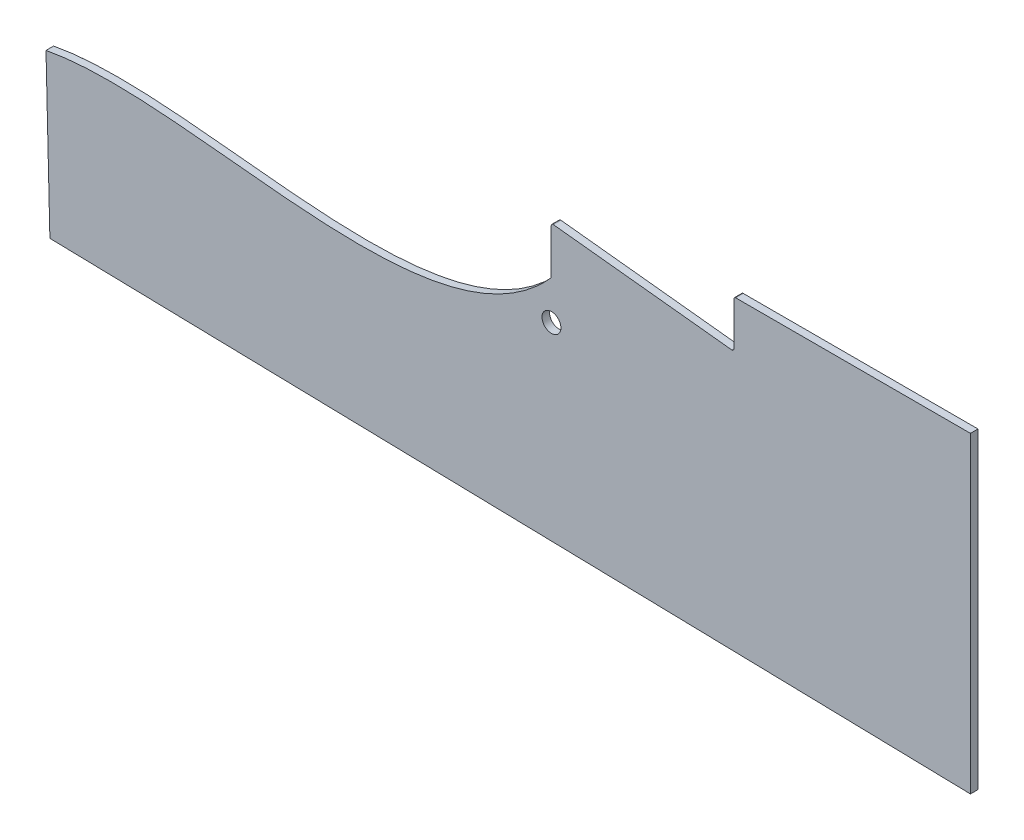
from build123d import *

# Parameters (mm, degrees)
DODANIE_WYCI_GNI_CIE1_DEPTH = 4
SZKIC2_R                    = 5
WYTNIJ_WYCI_GNI_CIE4_DEPTH  = 10
ZAOKR_GLENIE1_R             = 1


with BuildPart() as part:
    # Szkic1 → Dodanie-wyci_gni_cie1 (new body)
    with BuildSketch(Plane.XY):
        with BuildLine():
            Line((0, 170.274469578), (0, 145.274469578))
            add(Edge.make_bspline(
                [(-266.919232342, 115.836998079), (-187.423838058, 131.051953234), (-61.056883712, 76.896757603), (0, 145.274469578)],
                knots=[0, 0, 0, 0, 1, 1, 1, 1], degree=3))
            Line((-266.919232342, 115.836998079), (-264.863208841, 30.861867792))
            Line((-264.863208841, 30.861867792), (221.456080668, 19.821649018))
            Line((221.456080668, 19.821649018), (221.456080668, 184.821649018))
            Line((221.456080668, 184.821649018), (96.456080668, 184.821649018))
            Line((96.456080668, 184.821649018), (96.456080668, 159.821649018))
            Line((96.456080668, 159.821649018), (0, 170.274469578))
        make_face()
    extrude(amount=DODANIE_WYCI_GNI_CIE1_DEPTH)

    # Szkic2 → Wytnij-wyci_gni_cie4 (cut)
    with BuildSketch(Plane.XY.offset(4)):
        with Locations((0.114655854, 124.872215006)):
            Circle(SZKIC2_R)
    extrude(amount=-WYTNIJ_WYCI_GNI_CIE4_DEPTH, mode=Mode.SUBTRACT)

    # Zaokr_glenie1
    zaokr_glenie1_edges = [part.edges().sort_by_distance(p)[0] for p in [
        (0, 145.274469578, 2),
        (0, 170.274469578, 2),
        (96.456080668, 159.821649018, 2),
        (96.456080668, 184.821649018, 2),
    ]]
    fillet(zaokr_glenie1_edges, radius=ZAOKR_GLENIE1_R)


solid = part.part
